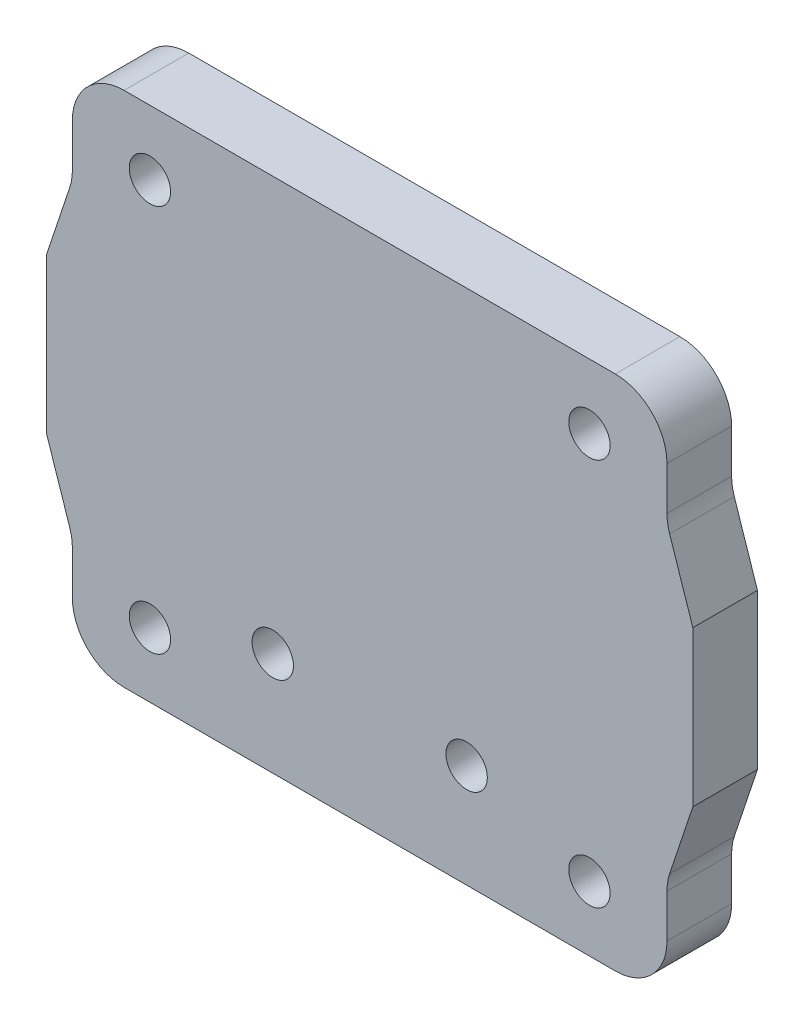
from build123d import *

# Parameters (mm, degrees)
SCHIZZO1_W                   = 46
SCHIZZO1_H                   = 40
ESTRUSIONE_ESTRUSIONE1_DEPTH = 5
ESTRUSIONE_ESTRUSIONE2_DEPTH = 5
RACCORDO1_R                  = 4
SCHIZZO3_R                   = 1.6
TAGLIO_ESTRUSIONE1_DEPTH     = 33.403703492


with BuildPart() as part:
    # Schizzo1 → Estrusione-Estrusione1 (new body)
    with BuildSketch(Plane.XY):
        Rectangle(SCHIZZO1_W, SCHIZZO1_H)
    extrude(amount=ESTRUSIONE_ESTRUSIONE1_DEPTH)

    # Schizzo2 → Estrusione-Estrusione2 (add)
    with BuildSketch(Plane.XY.offset(5)):
        Polygon((-25, -6), (-25, 6), (-23, 12), (-23, -12), align=None)
        Polygon((23, 12), (23, -12), (25, -6), (25, 6), align=None)
    extrude(amount=-ESTRUSIONE_ESTRUSIONE2_DEPTH)

    # Raccordo1
    raccordo1_edges = [part.edges().sort_by_distance(p)[0] for p in [
        (23, 12, 2.5),
        (23, -12, 2.5),
        (-23, 12, 2.5),
        (-23, -12, 2.5),
        (23, -20, 2.5),
        (-23, -20, 2.5),
        (-23, 20, 2.5),
        (23, 20, 2.5),
    ]]
    fillet(raccordo1_edges, radius=RACCORDO1_R)

    # Schizzo3 → Taglio-Estrusione1 (cut, through all)
    with BuildSketch(Plane.XY.offset(5)):
        with Locations((-17, 15)):
            Circle(SCHIZZO3_R)
        with Locations((17, 15)):
            Circle(SCHIZZO3_R)
        with Locations((17, -15)):
            Circle(SCHIZZO3_R)
        with Locations((-17, -15)):
            Circle(SCHIZZO3_R)
        with Locations((-7.5, -12)):
            Circle(SCHIZZO3_R)
        with Locations((7.5, -12)):
            Circle(SCHIZZO3_R)
    extrude(amount=-TAGLIO_ESTRUSIONE1_DEPTH, mode=Mode.SUBTRACT)


solid = part.part
